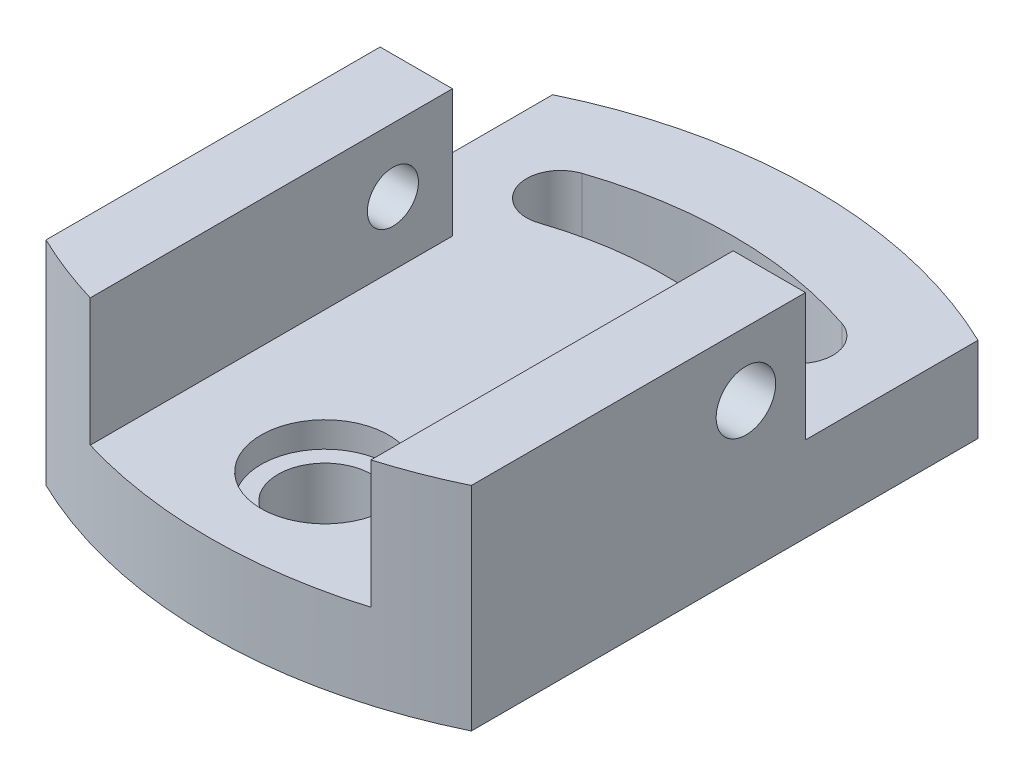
from build123d import *

# Parameters (mm, degrees)
SKETCH1_W           = 100
SKETCH1_H           = 142
BOSS_EXTRUDE1_DEPTH = 50
CUT_EXTRUDE1_REACH  = 160.632
SKETCH2_W           = 66
SKETCH2_H           = 30
SKETCH6_W           = 100
SKETCH6_H           = 52
CUT_EXTRUDE2_DEPTH  = 30
CUT_EXTRUDE3_REACH  = 93.875
SKETCH9_R           = 5
CUT_EXTRUDE4_DEPTH  = 101.204790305
HOLE2_D             = 22
HOLE2_CBORE_D       = 30
HOLE2_CBORE_DEPTH   = 6
SKETCH13_R          = 7
CUT_EXTRUDE5_DEPTH  = 50
SKETCH14_R          = 6
CUT_EXTRUDE6_DEPTH  = 50


with BuildPart() as part:
    # Sketch1 → Boss-Extrude1 (new body)
    with BuildSketch(Plane(origin=(0, 0, 0), x_dir=(1, 0, 0), z_dir=(0, 1, 0))):
        Rectangle(SKETCH1_W, SKETCH1_H)
    extrude(amount=BOSS_EXTRUDE1_DEPTH)

    # Sketch2 → Cut-Extrude1 (cut, up to next)
    with BuildSketch(Plane.XY.offset(71), mode=Mode.PRIVATE) as cut_extrude1_sk1:
        with Locations((0, 35)):
            Rectangle(SKETCH2_W, SKETCH2_H)
    cut_extrude1_tool1 = extrude(cut_extrude1_sk1.sketch, amount=-CUT_EXTRUDE1_REACH, mode=Mode.PRIVATE) & part.part
    add(cut_extrude1_tool1.solids().sort_by_distance((0, 35, 71))[0], mode=Mode.SUBTRACT)

    # Sketch6 → Cut-Extrude2 (cut)
    with BuildSketch(Plane(origin=(0, 50, 0), x_dir=(1, 0, 0), z_dir=(0, 1, 0))):
        with Locations((0, 45)):
            Rectangle(SKETCH6_W, SKETCH6_H)
    extrude(amount=-CUT_EXTRUDE2_DEPTH, mode=Mode.SUBTRACT)

    # Sketch9 → Cut-Extrude3 (cut, up to next)
    with BuildSketch(Plane(origin=(0, 20, 0), x_dir=(1, 0, 0), z_dir=(0, 1, 0)), mode=Mode.PRIVATE) as cut_extrude3_sk1:
        with Locations(Location((0, -44, 0), (0, 0, 270))):
            Circle(SKETCH9_R)
    cut_extrude3_tool1 = extrude(cut_extrude3_sk1.sketch, amount=-CUT_EXTRUDE3_REACH, mode=Mode.PRIVATE) & part.part
    # Sketch9 → Cut-Extrude3 (cut, up to next)
    with BuildSketch(Plane(origin=(0, 20, 0), x_dir=(1, 0, 0), z_dir=(0, 1, 0)), mode=Mode.PRIVATE) as cut_extrude3_sk2:
        with BuildLine():
            ThreePointArc((30.545454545, 47.010852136), (0, 52), (-30.545454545, 47.010852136))
            ThreePointArc((-30.545454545, 47.010852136), (-35.584237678, 36.881159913), (-25.454545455, 31.84237678))
            ThreePointArc((-25.454545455, 31.84237678), (0, 36), (25.454545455, 31.84237678))
            ThreePointArc((25.454545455, 31.84237678), (35.584237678, 36.881159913), (30.545454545, 47.010852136))
        make_face()
    cut_extrude3_tool2 = extrude(cut_extrude3_sk2.sketch, amount=-CUT_EXTRUDE3_REACH, mode=Mode.PRIVATE) & part.part
    add(cut_extrude3_tool1.solids().sort_by_distance((0, 20, 44))[0], mode=Mode.SUBTRACT)
    add(cut_extrude3_tool2.solids().sort_by_distance((0, 20, -41.92033))[0], mode=Mode.SUBTRACT)

    # Sketch10 → Cut-Extrude4 (cut, through all)
    with BuildSketch(Plane(origin=(0, 50, 0), x_dir=(1, 0, 0), z_dir=(0, 1, 0))):
        with BuildLine():
            ThreePointArc((-50, 59.561575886), (-25.645845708, 68.103927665), (-6.2e-07, 71))
            Line((-6.2e-07, 71), (-50, 71))
            Line((-50, 71), (-50, 59.561575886))
        make_face()
        with BuildLine():
            ThreePointArc((-6.2e-07, 71), (25.645845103, 68.103927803), (50, 59.561575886))
            Line((50, 59.561575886), (50, 71))
            Line((50, 71), (-6.2e-07, 71))
        make_face()
        with BuildLine():
            ThreePointArc((50, -59.561575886), (25.645845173, -68.103927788), (-4.78e-07, -71))
            Line((-4.78e-07, -71), (50, -71))
            Line((50, -71), (50, -59.561575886))
        make_face()
        with BuildLine():
            ThreePointArc((-33, -66.163514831), (-41.631074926, -63.200063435), (-50, -59.561575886))
            Line((-50, -59.561575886), (-50, -71))
            Line((-50, -71), (-33, -71))
            Line((-33, -71), (-33, -66.163514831))
        make_face()
        with BuildLine():
            ThreePointArc((-4.78e-07, -71), (-16.67626772, -69.78445454), (-33, -66.163514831))
            Line((-33, -66.163514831), (-33, -71))
            Line((-33, -71), (-4.78e-07, -71))
        make_face()
    extrude(amount=-CUT_EXTRUDE4_DEPTH, mode=Mode.SUBTRACT)

    # Hole2 (through all)
    with Locations(Plane(origin=(0, 20, 0), x_dir=(1, 0, 0), z_dir=(0, 1, 0))):
        with Locations((0, -44)):
            CounterBoreHole(HOLE2_D / 2, HOLE2_CBORE_D / 2, HOLE2_CBORE_DEPTH)

    # Sketch13 → Cut-Extrude5 (cut)
    with BuildSketch(Plane(origin=(50, 0, 0), x_dir=(0, 0, -1), z_dir=(1, 0, 0))):
        with Locations((5, 35)):
            Circle(SKETCH13_R)
    extrude(amount=-CUT_EXTRUDE5_DEPTH, mode=Mode.SUBTRACT)

    # Sketch14 → Cut-Extrude6 (cut)
    with BuildSketch(Plane.ZY.offset(50)):
        with Locations((-5, 35)):
            Circle(SKETCH14_R)
    extrude(amount=-CUT_EXTRUDE6_DEPTH, mode=Mode.SUBTRACT)


solid = part.part
